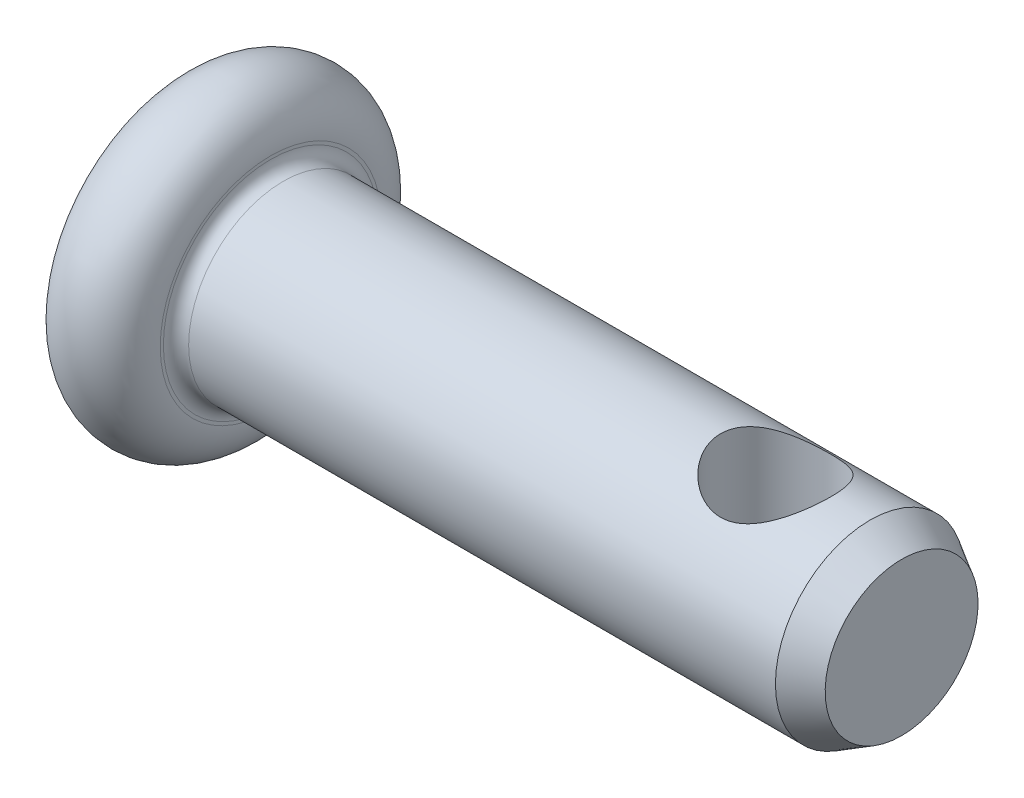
ISO-10303-21;
HEADER;
FILE_DESCRIPTION(('STEP AP214'),'2;1');
FILE_NAME('part.step','',(''),(''),'','','');
FILE_SCHEMA(('AUTOMOTIVE_DESIGN { 1 0 10303 214 1 1 1 1 }'));
ENDSEC;
DATA;
#1=APPLICATION_CONTEXT('core data for automotive mechanical design processes');
#2=APPLICATION_PROTOCOL_DEFINITION('international standard','automotive_design',2000,#1);
#3=PRODUCT_CONTEXT('',#1,'mechanical');
#4=PRODUCT('Part','Part','',(#3));
#5=PRODUCT_RELATED_PRODUCT_CATEGORY('part','',(#4));
#6=PRODUCT_DEFINITION_FORMATION('','',#4);
#7=PRODUCT_DEFINITION_CONTEXT('part definition',#1,'design');
#8=PRODUCT_DEFINITION('design','',#6,#7);
#9=PRODUCT_DEFINITION_SHAPE('','',#8);
#10=(LENGTH_UNIT() NAMED_UNIT(*) SI_UNIT(.MILLI.,.METRE.));
#11=(NAMED_UNIT(*) PLANE_ANGLE_UNIT() SI_UNIT($,.RADIAN.));
#12=(NAMED_UNIT(*) SI_UNIT($,.STERADIAN.) SOLID_ANGLE_UNIT());
#13=UNCERTAINTY_MEASURE_WITH_UNIT(LENGTH_MEASURE(1.E-05),#10,'distance_accuracy_value','');
#14=(GEOMETRIC_REPRESENTATION_CONTEXT(3) GLOBAL_UNCERTAINTY_ASSIGNED_CONTEXT((#13)) GLOBAL_UNIT_ASSIGNED_CONTEXT((#10,
#11,#12)) REPRESENTATION_CONTEXT('',''));
#15=CARTESIAN_POINT('',(0.,0.,0.));
#16=DIRECTION('',(0.,0.,1.));
#17=DIRECTION('',(1.,0.,0.));
#18=AXIS2_PLACEMENT_3D('',#15,#16,#17);
#19=CARTESIAN_POINT('',(11.5,0.,0.));
#20=DIRECTION('',(-1.,0.,0.));
#21=DIRECTION('',(0.,-1.,0.));
#22=AXIS2_PLACEMENT_3D('',#19,#20,#21);
#23=PLANE('',#22);
#24=CARTESIAN_POINT('',(11.5,0.,0.));
#25=DIRECTION('',(-1.,0.,0.));
#26=DIRECTION('',(0.,-1.,0.));
#27=AXIS2_PLACEMENT_3D('',#24,#25,#26);
#28=CIRCLE('',#27,1.21132486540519);
#29=CARTESIAN_POINT('',(11.5,-1.21132486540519,0.));
#30=VERTEX_POINT('',#29);
#31=EDGE_CURVE('E111',#30,#30,#28,.T.);
#32=ORIENTED_EDGE('',*,*,#31,.F.);
#33=EDGE_LOOP('',(#32));
#34=FACE_BOUND('',#33,.T.);
#35=ADVANCED_FACE('F37',(#34),#23,.F.);
#36=CARTESIAN_POINT('',(0.,0.,0.));
#37=DIRECTION('',(1.,0.,0.));
#38=DIRECTION('',(0.,1.,0.));
#39=AXIS2_PLACEMENT_3D('',#36,#37,#38);
#40=PLANE('',#39);
#41=CARTESIAN_POINT('',(0.,0.,0.));
#42=DIRECTION('',(-1.,0.,0.));
#43=DIRECTION('',(0.,-1.,0.));
#44=AXIS2_PLACEMENT_3D('',#41,#42,#43);
#45=CIRCLE('',#44,1.75);
#46=CARTESIAN_POINT('',(0.,-1.75,0.));
#47=VERTEX_POINT('',#46);
#48=EDGE_CURVE('E55',#47,#47,#45,.T.);
#49=ORIENTED_EDGE('',*,*,#48,.T.);
#50=EDGE_LOOP('',(#49));
#51=FACE_BOUND('',#50,.T.);
#52=ADVANCED_FACE('F87',(#51),#40,.F.);
#53=CARTESIAN_POINT('',(0.750000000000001,0.,0.));
#54=DIRECTION('',(-1.,0.,0.));
#55=DIRECTION('',(0.,-1.,0.));
#56=AXIS2_PLACEMENT_3D('',#53,#54,#55);
#57=TOROIDAL_SURFACE('',#56,1.75,0.75);
#58=ORIENTED_EDGE('',*,*,#48,.F.);
#59=EDGE_LOOP('',(#58));
#60=FACE_BOUND('',#59,.T.);
#61=CARTESIAN_POINT('',(1.5,0.,0.));
#62=DIRECTION('',(-1.,0.,0.));
#63=DIRECTION('',(0.,-1.,0.));
#64=AXIS2_PLACEMENT_3D('',#61,#62,#63);
#65=CIRCLE('',#64,1.75);
#66=CARTESIAN_POINT('',(1.5,-1.75,0.));
#67=VERTEX_POINT('',#66);
#68=EDGE_CURVE('E105',#67,#67,#65,.T.);
#69=ORIENTED_EDGE('',*,*,#68,.T.);
#70=EDGE_LOOP('',(#69));
#71=FACE_BOUND('',#70,.T.);
#72=ADVANCED_FACE('F92',(#60,#71),#57,.T.);
#73=CARTESIAN_POINT('',(1.5,1.5,0.));
#74=DIRECTION('',(-1.,0.,0.));
#75=DIRECTION('',(0.,-1.,0.));
#76=AXIS2_PLACEMENT_3D('',#73,#74,#75);
#77=PLANE('',#76);
#78=CARTESIAN_POINT('',(1.5,0.,0.));
#79=DIRECTION('',(-1.,0.,0.));
#80=DIRECTION('',(0.,-1.,0.));
#81=AXIS2_PLACEMENT_3D('',#78,#79,#80);
#82=CIRCLE('',#81,1.7);
#83=CARTESIAN_POINT('',(1.5,-1.7,0.));
#84=VERTEX_POINT('',#83);
#85=EDGE_CURVE('E50',#84,#84,#82,.T.);
#86=ORIENTED_EDGE('',*,*,#85,.T.);
#87=EDGE_LOOP('',(#86));
#88=FACE_BOUND('',#87,.T.);
#89=ORIENTED_EDGE('',*,*,#68,.F.);
#90=EDGE_LOOP('',(#89));
#91=FACE_BOUND('',#90,.T.);
#92=ADVANCED_FACE('F82',(#88,#91),#77,.F.);
#93=CARTESIAN_POINT('',(-19.830028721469,0.,0.));
#94=DIRECTION('',(-1.,0.,0.));
#95=DIRECTION('',(0.,-1.,0.));
#96=AXIS2_PLACEMENT_3D('',#93,#94,#95);
#97=CYLINDRICAL_SURFACE('',#96,1.5);
#98=CARTESIAN_POINT('',(10.37,-1.5,0.));
#99=CARTESIAN_POINT('',(10.3699947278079,-1.49999542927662,-0.0447702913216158));
#100=CARTESIAN_POINT('',(10.3665215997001,-1.49797414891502,-0.0895909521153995));
#101=CARTESIAN_POINT('',(10.3527948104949,-1.49007687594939,-0.17789946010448));
#102=CARTESIAN_POINT('',(10.3425249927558,-1.48419169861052,-0.221383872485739));
#103=CARTESIAN_POINT('',(10.315769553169,-1.46916923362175,-0.305549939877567));
#104=CARTESIAN_POINT('',(10.2993134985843,-1.46004742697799,-0.346243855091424));
#105=CARTESIAN_POINT('',(10.2608294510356,-1.43933975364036,-0.424180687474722));
#106=CARTESIAN_POINT('',(10.2388027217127,-1.42775444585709,-0.461424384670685));
#107=CARTESIAN_POINT('',(10.187992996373,-1.40211189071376,-0.534499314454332));
#108=CARTESIAN_POINT('',(10.158832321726,-1.3879355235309,-0.570025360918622));
#109=CARTESIAN_POINT('',(10.0954212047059,-1.3589812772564,-0.635979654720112));
#110=CARTESIAN_POINT('',(10.0611646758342,-1.34420269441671,-0.666401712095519));
#111=CARTESIAN_POINT('',(9.98397041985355,-1.31374623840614,-0.724755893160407));
#112=CARTESIAN_POINT('',(9.94048934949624,-1.29815491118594,-0.752020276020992));
#113=CARTESIAN_POINT('',(9.84864976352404,-1.26994565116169,-0.798740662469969));
#114=CARTESIAN_POINT('',(9.8002989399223,-1.25732313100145,-0.818208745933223));
#115=CARTESIAN_POINT('',(9.71133234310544,-1.23948311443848,-0.844913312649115));
#116=CARTESIAN_POINT('',(9.67145642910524,-1.23323460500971,-0.853924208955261));
#117=CARTESIAN_POINT('',(9.59044053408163,-1.2246079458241,-0.866253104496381));
#118=CARTESIAN_POINT('',(9.54930202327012,-1.22222545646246,-0.869577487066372));
#119=CARTESIAN_POINT('',(9.46687895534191,-1.22167753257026,-0.870347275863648));
#120=CARTESIAN_POINT('',(9.42559427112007,-1.22351854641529,-0.867783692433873));
#121=CARTESIAN_POINT('',(9.34415472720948,-1.23115363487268,-0.856914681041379));
#122=CARTESIAN_POINT('',(9.3040006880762,-1.23695050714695,-0.848605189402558));
#123=CARTESIAN_POINT('',(9.22606626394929,-1.25167101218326,-0.826734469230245));
#124=CARTESIAN_POINT('',(9.18827244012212,-1.26057458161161,-0.813206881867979));
#125=CARTESIAN_POINT('',(9.11537838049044,-1.2805476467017,-0.781377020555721));
#126=CARTESIAN_POINT('',(9.08027916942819,-1.29161796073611,-0.763072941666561));
#127=CARTESIAN_POINT('',(9.00763201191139,-1.31688327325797,-0.718728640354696));
#128=CARTESIAN_POINT('',(8.97063274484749,-1.33129261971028,-0.691910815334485));
#129=CARTESIAN_POINT('',(8.90129656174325,-1.3603506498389,-0.632874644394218));
#130=CARTESIAN_POINT('',(8.86896382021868,-1.37499953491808,-0.600651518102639));
#131=CARTESIAN_POINT('',(8.80592803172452,-1.40498274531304,-0.527053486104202));
#132=CARTESIAN_POINT('',(8.77589671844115,-1.42018518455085,-0.485042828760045));
#133=CARTESIAN_POINT('',(8.72343576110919,-1.44763681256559,-0.395637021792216));
#134=CARTESIAN_POINT('',(8.70100149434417,-1.45988779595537,-0.348245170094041));
#135=CARTESIAN_POINT('',(8.66606274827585,-1.47930905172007,-0.252698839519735));
#136=CARTESIAN_POINT('',(8.65298875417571,-1.48676718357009,-0.204813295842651));
#137=CARTESIAN_POINT('',(8.63518603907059,-1.49697971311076,-0.107043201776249));
#138=CARTESIAN_POINT('',(8.63044858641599,-1.49973903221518,-0.0571607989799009));
#139=CARTESIAN_POINT('',(8.6296643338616,-1.5001953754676,0.0363974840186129));
#140=CARTESIAN_POINT('',(8.63260069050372,-1.49848471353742,0.0800659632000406));
#141=CARTESIAN_POINT('',(8.64491097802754,-1.4913925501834,0.166173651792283));
#142=CARTESIAN_POINT('',(8.65428495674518,-1.48601102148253,0.208612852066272));
#143=CARTESIAN_POINT('',(8.678849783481,-1.47217081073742,0.290546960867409));
#144=CARTESIAN_POINT('',(8.69395634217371,-1.46375680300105,0.330075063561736));
#145=CARTESIAN_POINT('',(8.72942801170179,-1.44452738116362,0.406052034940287));
#146=CARTESIAN_POINT('',(8.74979431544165,-1.43371142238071,0.442500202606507));
#147=CARTESIAN_POINT('',(8.79759365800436,-1.40925839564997,0.515381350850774));
#148=CARTESIAN_POINT('',(8.82554216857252,-1.39544475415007,0.551416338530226));
#149=CARTESIAN_POINT('',(8.88653495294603,-1.36700802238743,0.618564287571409));
#150=CARTESIAN_POINT('',(8.91958513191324,-1.35238400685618,0.649671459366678));
#151=CARTESIAN_POINT('',(8.99439538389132,-1.32190533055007,0.709810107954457));
#152=CARTESIAN_POINT('',(9.03672237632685,-1.30610752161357,0.738170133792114));
#153=CARTESIAN_POINT('',(9.12635094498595,-1.27707776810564,0.787331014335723));
#154=CARTESIAN_POINT('',(9.17364613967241,-1.26384259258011,0.808141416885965));
#155=CARTESIAN_POINT('',(9.26155578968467,-1.24440169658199,0.837679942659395));
#156=CARTESIAN_POINT('',(9.30142031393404,-1.23729643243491,0.848043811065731));
#157=CARTESIAN_POINT('',(9.38267884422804,-1.22688564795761,0.863039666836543));
#158=CARTESIAN_POINT('',(9.42407093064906,-1.22357551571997,0.867678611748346));
#159=CARTESIAN_POINT('',(9.50732174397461,-1.22123673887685,0.870968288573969));
#160=CARTESIAN_POINT('',(9.54918137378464,-1.22221873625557,0.869604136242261));
#161=CARTESIAN_POINT('',(9.63197985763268,-1.22833617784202,0.860939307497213));
#162=CARTESIAN_POINT('',(9.6729181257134,-1.23347419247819,0.853634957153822));
#163=CARTESIAN_POINT('',(9.75174081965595,-1.24699641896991,0.833749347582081));
#164=CARTESIAN_POINT('',(9.78967684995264,-1.25529321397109,0.821309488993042));
#165=CARTESIAN_POINT('',(9.8629973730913,-1.27420943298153,0.791643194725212));
#166=CARTESIAN_POINT('',(9.89838094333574,-1.2848296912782,0.774415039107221));
#167=CARTESIAN_POINT('',(9.97143584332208,-1.30919349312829,0.732587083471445));
#168=CARTESIAN_POINT('',(10.0086136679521,-1.323166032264,0.70725905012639));
#169=CARTESIAN_POINT('',(10.0785561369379,-1.35159343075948,0.651292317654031));
#170=CARTESIAN_POINT('',(10.1113167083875,-1.36604872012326,0.620648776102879));
#171=CARTESIAN_POINT('',(10.1760264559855,-1.39613139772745,0.549985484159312));
#172=CARTESIAN_POINT('',(10.207259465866,-1.41165086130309,0.509257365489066));
#173=CARTESIAN_POINT('',(10.2623885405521,-1.44006182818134,0.422265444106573));
#174=CARTESIAN_POINT('',(10.2862887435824,-1.45295481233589,0.376004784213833));
#175=CARTESIAN_POINT('',(10.3221446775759,-1.47269872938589,0.287793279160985));
#176=CARTESIAN_POINT('',(10.3354709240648,-1.48021734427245,0.246546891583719));
#177=CARTESIAN_POINT('',(10.3558524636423,-1.49181475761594,0.16214033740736));
#178=CARTESIAN_POINT('',(10.3629250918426,-1.49590306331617,0.118985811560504));
#179=CARTESIAN_POINT('',(10.3689061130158,-1.49936555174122,0.0504096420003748));
#180=CARTESIAN_POINT('',(10.3700029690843,-1.50000257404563,0.025212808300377));
#181=CARTESIAN_POINT('',(10.37,-1.5,0.));
#182=B_SPLINE_CURVE_WITH_KNOTS('',3,(#98,#99,#100,#101,#102,#103,#104,#105,#106,#107,#108,#109,
#110,#111,#112,#113,#114,#115,#116,#117,#118,#119,#120,#121,#122,#123,#124,#125,#126,#127,#128,
#129,#130,#131,#132,#133,#134,#135,#136,#137,#138,#139,#140,#141,#142,#143,#144,#145,#146,#147,
#148,#149,#150,#151,#152,#153,#154,#155,#156,#157,#158,#159,#160,#161,#162,#163,#164,#165,#166,
#167,#168,#169,#170,#171,#172,#173,#174,#175,#176,#177,#178,#179,#180,#181),.UNSPECIFIED.,.T.,
.F.,(4,2,2,2,2,2,2,2,2,2,2,2,2,2,2,2,2,2,2,2,2,2,2,2,2,2,2,2,2,2,2,2,2,2,2,2,2,2,2,2,2,4),(0.,
0.134224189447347,0.268768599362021,0.402677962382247,0.536556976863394,0.680279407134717,
0.82417489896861,0.984298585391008,1.14417320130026,1.26770857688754,1.39110518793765,
1.514690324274,1.63836295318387,1.76125124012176,1.88418603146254,2.02736658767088,
2.17067444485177,2.33134008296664,2.49190778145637,2.64160292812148,2.79114119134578,
2.92189680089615,3.05265338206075,3.18155752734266,3.31049093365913,3.4528705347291,
3.59541619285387,3.75468183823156,3.91374535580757,4.03860940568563,4.16332155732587,
4.28834309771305,4.41344202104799,4.53530466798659,4.65721114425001,4.79798525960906,
4.938888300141,5.09895237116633,5.25892594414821,5.39034697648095,5.52140255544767,
5.596992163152),.UNSPECIFIED.);
#183=CARTESIAN_POINT('',(10.37,-1.5,0.));
#184=VERTEX_POINT('',#183);
#185=EDGE_CURVE('E41',#184,#184,#182,.T.);
#186=ORIENTED_EDGE('',*,*,#185,.T.);
#187=EDGE_LOOP('',(#186));
#188=FACE_BOUND('',#187,.T.);
#189=CARTESIAN_POINT('',(9.5,1.22192471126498,0.870000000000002));
#190=CARTESIAN_POINT('',(9.45587749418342,1.2219250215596,0.869999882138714));
#191=CARTESIAN_POINT('',(9.41175377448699,1.22435052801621,0.866622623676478));
#192=CARTESIAN_POINT('',(9.32496689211,1.23363970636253,0.853343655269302));
#193=CARTESIAN_POINT('',(9.28230529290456,1.24050798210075,0.843435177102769));
#194=CARTESIAN_POINT('',(9.19987100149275,1.25759958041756,0.817726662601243));
#195=CARTESIAN_POINT('',(9.16008105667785,1.2678003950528,0.801966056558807));
#196=CARTESIAN_POINT('',(9.08372888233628,1.29036758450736,0.765125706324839));
#197=CARTESIAN_POINT('',(9.04716769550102,1.30273465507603,0.744044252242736));
#198=CARTESIAN_POINT('',(8.97375788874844,1.32993946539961,0.694370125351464));
#199=CARTESIAN_POINT('',(8.9373470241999,1.34489833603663,0.665196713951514));
#200=CARTESIAN_POINT('',(8.86957628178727,1.37462956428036,0.601360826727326));
#201=CARTESIAN_POINT('',(8.83821983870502,1.38940178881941,0.566694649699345));
#202=CARTESIAN_POINT('',(8.77839334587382,1.41882772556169,0.488701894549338));
#203=CARTESIAN_POINT('',(8.75051331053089,1.43332594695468,0.444858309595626));
#204=CARTESIAN_POINT('',(8.70273083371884,1.45887973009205,0.352102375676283));
#205=CARTESIAN_POINT('',(8.68282158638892,1.4699382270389,0.303194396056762));
#206=CARTESIAN_POINT('',(8.65346007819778,1.48647129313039,0.20637830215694));
#207=CARTESIAN_POINT('',(8.64322441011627,1.49236069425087,0.158780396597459));
#208=CARTESIAN_POINT('',(8.63086667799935,1.49948849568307,0.0622138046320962));
#209=CARTESIAN_POINT('',(8.62873762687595,1.50073090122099,0.0132463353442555));
#210=CARTESIAN_POINT('',(8.63247920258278,1.49856340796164,-0.078546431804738));
#211=CARTESIAN_POINT('',(8.63744976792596,1.49567689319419,-0.121424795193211));
#212=CARTESIAN_POINT('',(8.65356050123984,1.48644414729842,-0.205613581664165));
#213=CARTESIAN_POINT('',(8.66470112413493,1.48009766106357,-0.246923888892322));
#214=CARTESIAN_POINT('',(8.69277707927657,1.46443589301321,-0.327290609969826));
#215=CARTESIAN_POINT('',(8.70975820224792,1.45509719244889,-0.36632627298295));
#216=CARTESIAN_POINT('',(8.74889931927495,1.43421702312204,-0.441054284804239));
#217=CARTESIAN_POINT('',(8.7710607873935,1.42267492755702,-0.47674567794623));
#218=CARTESIAN_POINT('',(8.82281976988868,1.39682249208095,-0.548169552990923));
#219=CARTESIAN_POINT('',(8.85297942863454,1.38234644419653,-0.583434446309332));
#220=CARTESIAN_POINT('',(8.91842125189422,1.35295176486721,-0.648695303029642));
#221=CARTESIAN_POINT('',(8.95370985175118,1.33803259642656,-0.678684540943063));
#222=CARTESIAN_POINT('',(9.0327988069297,1.30763388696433,-0.735691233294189));
#223=CARTESIAN_POINT('',(9.07710320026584,1.29225852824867,-0.762071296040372));
#224=CARTESIAN_POINT('',(9.17049313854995,1.26479274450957,-0.806841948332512));
#225=CARTESIAN_POINT('',(9.2195698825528,1.25269642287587,-0.825246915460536));
#226=CARTESIAN_POINT('',(9.30926834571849,1.23612991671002,-0.849792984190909));
#227=CARTESIAN_POINT('',(9.3491728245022,1.23053642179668,-0.857798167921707));
#228=CARTESIAN_POINT('',(9.43004602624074,1.22326558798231,-0.868138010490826));
#229=CARTESIAN_POINT('',(9.47101362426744,1.22158426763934,-0.870478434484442));
#230=CARTESIAN_POINT('',(9.5528575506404,1.22238173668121,-0.869357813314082));
#231=CARTESIAN_POINT('',(9.59373377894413,1.22486387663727,-0.865892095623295));
#232=CARTESIAN_POINT('',(9.6742049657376,1.23362980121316,-0.853354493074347));
#233=CARTESIAN_POINT('',(9.71379894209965,1.23991643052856,-0.844278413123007));
#234=CARTESIAN_POINT('',(9.79112271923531,1.25554859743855,-0.820850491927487));
#235=CARTESIAN_POINT('',(9.82883309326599,1.26492051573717,-0.806453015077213));
#236=CARTESIAN_POINT('',(9.90144526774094,1.28570812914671,-0.772880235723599));
#237=CARTESIAN_POINT('',(9.93634594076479,1.29712463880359,-0.753703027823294));
#238=CARTESIAN_POINT('',(10.0086523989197,1.32306490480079,-0.707332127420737));
#239=CARTESIAN_POINT('',(10.0454691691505,1.33778643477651,-0.679328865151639));
#240=CARTESIAN_POINT('',(10.114237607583,1.36726805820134,-0.617852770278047));
#241=CARTESIAN_POINT('',(10.1461849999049,1.38202817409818,-0.584375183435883));
#242=CARTESIAN_POINT('',(10.2077705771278,1.41182005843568,-0.508524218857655));
#243=CARTESIAN_POINT('',(10.2367828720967,1.42670777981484,-0.465579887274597));
#244=CARTESIAN_POINT('',(10.2870120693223,1.45328371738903,-0.374449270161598));
#245=CARTESIAN_POINT('',(10.3082349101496,1.46497436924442,-0.326267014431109));
#246=CARTESIAN_POINT('',(10.3404521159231,1.48300249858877,-0.230014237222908));
#247=CARTESIAN_POINT('',(10.3521248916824,1.48969134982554,-0.18223867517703));
#248=CARTESIAN_POINT('',(10.3672306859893,1.49838221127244,-0.0849998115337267));
#249=CARTESIAN_POINT('',(10.3706715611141,1.50038869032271,-0.0355381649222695));
#250=CARTESIAN_POINT('',(10.3692039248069,1.49953899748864,0.057174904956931));
#251=CARTESIAN_POINT('',(10.3652589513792,1.49724394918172,0.100450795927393));
#252=CARTESIAN_POINT('',(10.3510665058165,1.4890870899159,0.185603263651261));
#253=CARTESIAN_POINT('',(10.3408187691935,1.48322512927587,0.22747978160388));
#254=CARTESIAN_POINT('',(10.3145310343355,1.46848335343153,0.308633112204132));
#255=CARTESIAN_POINT('',(10.2985099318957,1.4596133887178,0.34791791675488));
#256=CARTESIAN_POINT('',(10.2612511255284,1.43956831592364,0.423279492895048));
#257=CARTESIAN_POINT('',(10.2400120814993,1.42839261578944,0.45935543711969));
#258=CARTESIAN_POINT('',(10.1902869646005,1.40324121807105,0.531535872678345));
#259=CARTESIAN_POINT('',(10.1612609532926,1.38909277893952,0.567207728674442));
#260=CARTESIAN_POINT('',(10.0981017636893,1.36016065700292,0.633461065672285));
#261=CARTESIAN_POINT('',(10.0639625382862,1.34537623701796,0.664036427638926));
#262=CARTESIAN_POINT('',(9.98704459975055,1.31488721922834,0.722690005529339));
#263=CARTESIAN_POINT('',(9.94372699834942,1.29926385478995,0.750109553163));
#264=CARTESIAN_POINT('',(9.85219677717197,1.2709296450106,0.797180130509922));
#265=CARTESIAN_POINT('',(9.80399088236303,1.25821487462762,0.816841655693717));
#266=CARTESIAN_POINT('',(9.71330891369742,1.23976678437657,0.844512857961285));
#267=CARTESIAN_POINT('',(9.67146929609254,1.23316860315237,0.854021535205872));
#268=CARTESIAN_POINT('',(9.58641901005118,1.22425003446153,0.866761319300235));
#269=CARTESIAN_POINT('',(9.54321008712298,1.221924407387,0.87000011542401));
#270=CARTESIAN_POINT('',(9.5,1.22192471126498,0.870000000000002));
#271=B_SPLINE_CURVE_WITH_KNOTS('',3,(#189,#190,#191,#192,#193,#194,#195,#196,#197,#198,#199,
#200,#201,#202,#203,#204,#205,#206,#207,#208,#209,#210,#211,#212,#213,#214,#215,#216,#217,#218,
#219,#220,#221,#222,#223,#224,#225,#226,#227,#228,#229,#230,#231,#232,#233,#234,#235,#236,#237,
#238,#239,#240,#241,#242,#243,#244,#245,#246,#247,#248,#249,#250,#251,#252,#253,#254,#255,#256,
#257,#258,#259,#260,#261,#262,#263,#264,#265,#266,#267,#268,#269,#270),.UNSPECIFIED.,.T.,.F.,(4,
2,2,2,2,2,2,2,2,2,2,2,2,2,2,2,2,2,2,2,2,2,2,2,2,2,2,2,2,2,2,2,2,2,2,2,2,2,2,2,4),(0.,
0.132186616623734,0.264510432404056,0.3959583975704,0.527448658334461,0.673853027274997,
0.82035647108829,0.981314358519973,1.14213451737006,1.28839783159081,1.43453505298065,
1.56370580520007,1.69288608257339,1.82310316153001,1.95335733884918,2.09859545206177,
2.2440173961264,2.40462570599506,2.5649432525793,2.68765311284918,2.81023803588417,
2.93292165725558,3.05569712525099,3.17955089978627,3.30345412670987,3.44850348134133,
3.59367948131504,3.7545952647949,3.91538811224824,4.06341245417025,4.21129546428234,
4.3412129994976,4.47113598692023,4.60063755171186,4.73017241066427,4.87394392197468,
5.01788682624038,5.17788115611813,5.33765828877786,5.46727044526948,5.59672354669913),.UNSPECIFIED.);
#272=CARTESIAN_POINT('',(9.5,1.22192471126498,0.870000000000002));
#273=VERTEX_POINT('',#272);
#274=EDGE_CURVE('E58',#273,#273,#271,.T.);
#275=ORIENTED_EDGE('',*,*,#274,.T.);
#276=EDGE_LOOP('',(#275));
#277=FACE_BOUND('',#276,.T.);
#278=CARTESIAN_POINT('',(1.7,0.,0.));
#279=DIRECTION('',(-1.,0.,0.));
#280=DIRECTION('',(0.,-1.,0.));
#281=AXIS2_PLACEMENT_3D('',#278,#279,#280);
#282=CIRCLE('',#281,1.5);
#283=CARTESIAN_POINT('',(1.7,-1.5,0.));
#284=VERTEX_POINT('',#283);
#285=EDGE_CURVE('E10',#284,#284,#282,.F.);
#286=ORIENTED_EDGE('',*,*,#285,.T.);
#287=EDGE_LOOP('',(#286));
#288=FACE_BOUND('',#287,.T.);
#289=CARTESIAN_POINT('',(11.,0.,0.));
#290=DIRECTION('',(-1.,0.,0.));
#291=DIRECTION('',(0.,-1.,0.));
#292=AXIS2_PLACEMENT_3D('',#289,#290,#291);
#293=CIRCLE('',#292,1.5);
#294=CARTESIAN_POINT('',(11.,-1.5,0.));
#295=VERTEX_POINT('',#294);
#296=EDGE_CURVE('E107',#295,#295,#293,.T.);
#297=ORIENTED_EDGE('',*,*,#296,.T.);
#298=EDGE_LOOP('',(#297));
#299=FACE_BOUND('',#298,.T.);
#300=ADVANCED_FACE('F63',(#188,#277,#288,#299),#97,.T.);
#301=CARTESIAN_POINT('',(11.5,0.,0.));
#302=DIRECTION('',(-1.,0.,0.));
#303=DIRECTION('',(0.,-1.,0.));
#304=AXIS2_PLACEMENT_3D('',#301,#302,#303);
#305=CONICAL_SURFACE('',#304,1.21132486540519,0.523598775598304);
#306=ORIENTED_EDGE('',*,*,#296,.F.);
#307=EDGE_LOOP('',(#306));
#308=FACE_BOUND('',#307,.T.);
#309=ORIENTED_EDGE('',*,*,#31,.T.);
#310=EDGE_LOOP('',(#309));
#311=FACE_BOUND('',#310,.T.);
#312=ADVANCED_FACE('F71',(#308,#311),#305,.T.);
#313=CARTESIAN_POINT('',(1.7,0.,0.));
#314=DIRECTION('',(-1.,0.,0.));
#315=DIRECTION('',(0.,-1.,0.));
#316=AXIS2_PLACEMENT_3D('',#313,#314,#315);
#317=TOROIDAL_SURFACE('',#316,1.7,0.2);
#318=ORIENTED_EDGE('',*,*,#285,.F.);
#319=EDGE_LOOP('',(#318));
#320=FACE_BOUND('',#319,.T.);
#321=ORIENTED_EDGE('',*,*,#85,.F.);
#322=EDGE_LOOP('',(#321));
#323=FACE_BOUND('',#322,.T.);
#324=ADVANCED_FACE('F39',(#320,#323),#317,.F.);
#325=CARTESIAN_POINT('',(9.5,-2.5,0.));
#326=DIRECTION('',(0.,1.,0.));
#327=DIRECTION('',(0.,0.,1.));
#328=AXIS2_PLACEMENT_3D('',#325,#326,#327);
#329=CYLINDRICAL_SURFACE('',#328,0.870000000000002);
#330=ORIENTED_EDGE('',*,*,#274,.F.);
#331=EDGE_LOOP('',(#330));
#332=FACE_BOUND('',#331,.T.);
#333=ORIENTED_EDGE('',*,*,#185,.F.);
#334=EDGE_LOOP('',(#333));
#335=FACE_BOUND('',#334,.T.);
#336=ADVANCED_FACE('F67',(#332,#335),#329,.F.);
#337=CLOSED_SHELL('',(#35,#52,#72,#92,#300,#312,#324,#336));
#338=MANIFOLD_SOLID_BREP('B2',#337);
#339=ADVANCED_BREP_SHAPE_REPRESENTATION('',(#18,#338),#14);
#340=SHAPE_DEFINITION_REPRESENTATION(#9,#339);
ENDSEC;
END-ISO-10303-21;
